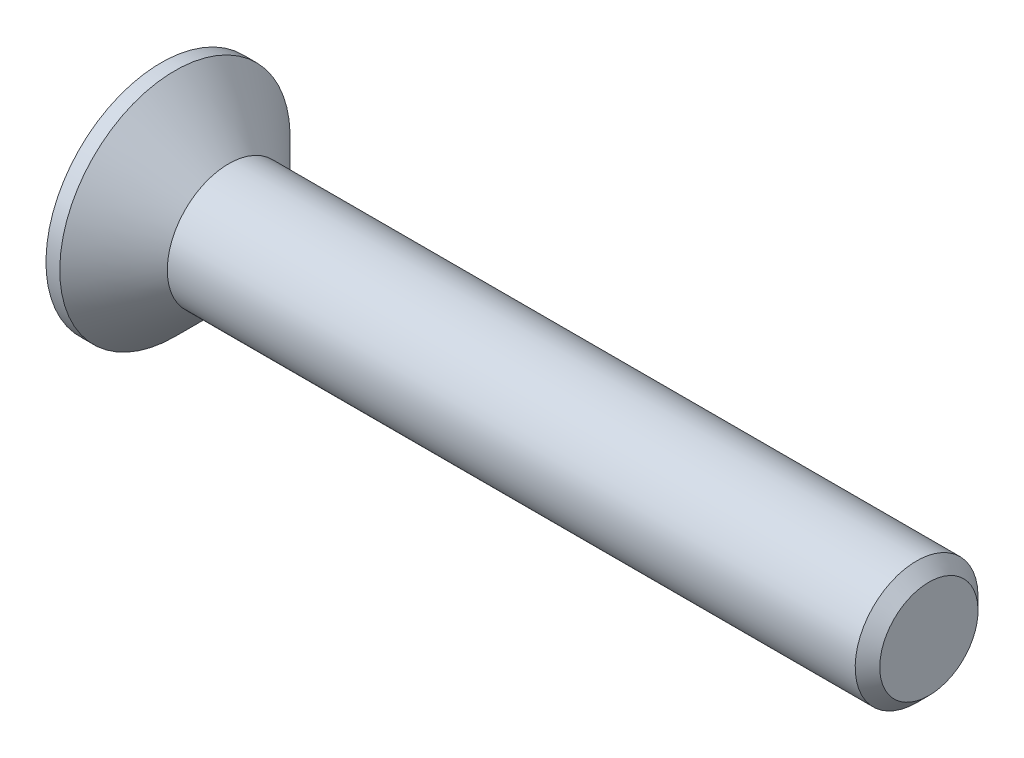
from build123d import *

# Parameters (mm, degrees)
CHAMFER1_SIZE      = 0.4
CUT_EXTRUDE1_DEPTH = 1.9


with BuildPart() as part:
    # Sketch1 → Revolve1 (revolve)
    with BuildSketch(Plane.XY, mode=Mode.PRIVATE) as revolve1_sk:
        Polygon((-2.2, 3.75), (-2.2, 0), (22.8, 0), (22.8, 2), (0, 2), (-1.75, 3.75), align=None)
    revolve(revolve1_sk.sketch.rotate(Axis((-2.2, 0, 0), (1, 0, 0)), 180), axis=Axis((-2.2, 0, 0), (1, 0, 0)))

    # Chamfer1
    chamfer1_edges = [part.edges().sort_by_distance(p)[0] for p in [
        (22.8, 2, 0),
    ]]
    chamfer(chamfer1_edges, length=CHAMFER1_SIZE)

    # Sketch2 → Cut-Extrude1 (cut)
    with BuildSketch(Plane.ZY.offset(2.2)):
        Polygon((-0.55, 2.2), (0.55, 2.2), (0.55, 0.55), (2.2, 0.55), (2.2, -0.55), (0.55, -0.55), (0.55, -2.2), (-0.55, -2.2), (-0.55, -0.55), (-2.2, -0.55), (-2.2, 0.55), (-0.55, 0.55), align=None)
    extrude(amount=-CUT_EXTRUDE1_DEPTH, mode=Mode.SUBTRACT)


solid = part.part
